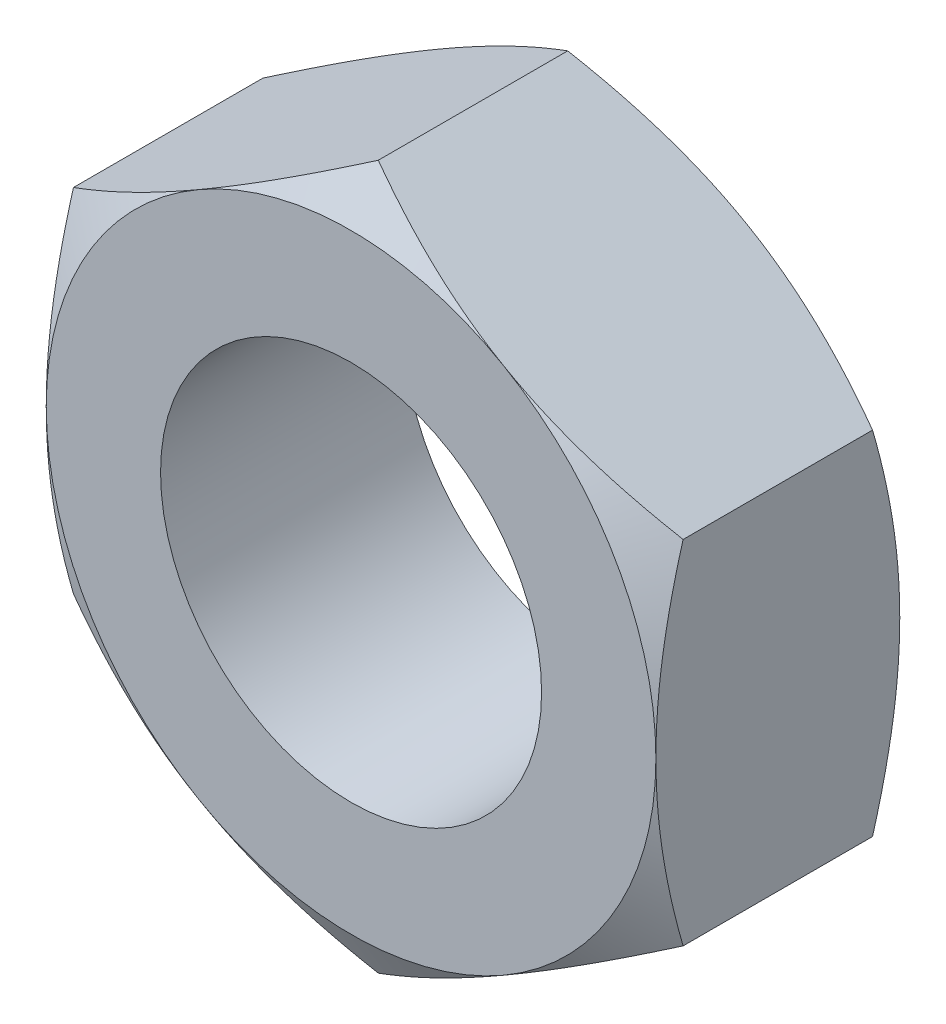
from build123d import *

# Parameters (mm, degrees)
BASE_EXTRUSION_DEPTH    = 6.4
ESQUISSE3_R             = 5
ENL_V_MAT_EXTRU_1_DEPTH = 14.794684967


with BuildPart() as part:
    # Esquisse1 → Base-Extrusion (new body)
    with BuildSketch(Plane.XY):
        Polygon((8, -4.618802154), (8, 4.618802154), (0, 9.237604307), (-8, 4.618802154), (-8, -4.618802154), (0, -9.237604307), align=None)
    extrude(amount=-BASE_EXTRUSION_DEPTH)

    # Esquisse2 → Enl_vement de mati_re-R_volution1 (revolve, cut)
    with BuildSketch(Plane(origin=(0, 0, 0), x_dir=(1, 0, 0), z_dir=(0, 1, 0)), mode=Mode.PRIVATE) as enl_vement_de_mati_re_r_volution1_sk:
        Polygon((-8, 0), (-14.542562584, 0), (-14.542562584, 6.4), (-8, 6.4), (-13.542562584, 3.2), align=None)
    revolve(enl_vement_de_mati_re_r_volution1_sk.sketch.rotate(Axis((0, 0, -6.4), (0, 0, 1)), 180), axis=Axis((0, 0, -6.4), (0, 0, 1)), mode=Mode.SUBTRACT)

    # Esquisse3 → Enl_v. mat.-Extru.1 (cut, through all)
    with BuildSketch(Plane.XY):
        Circle(ESQUISSE3_R)
    extrude(amount=-ENL_V_MAT_EXTRU_1_DEPTH, mode=Mode.SUBTRACT)


solid = part.part
